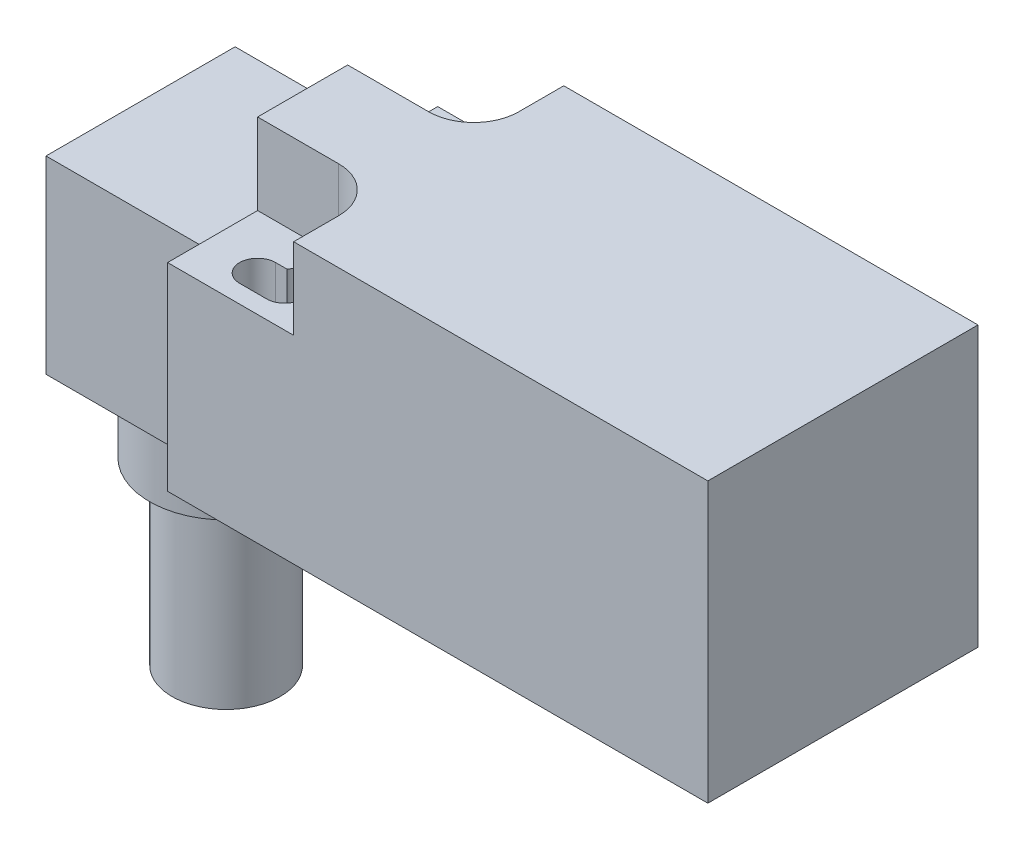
ISO-10303-21;
HEADER;
FILE_DESCRIPTION(('STEP AP214'),'2;1');
FILE_NAME('part.step','',(''),(''),'','','');
FILE_SCHEMA(('AUTOMOTIVE_DESIGN { 1 0 10303 214 1 1 1 1 }'));
ENDSEC;
DATA;
#1=APPLICATION_CONTEXT('core data for automotive mechanical design processes');
#2=APPLICATION_PROTOCOL_DEFINITION('international standard','automotive_design',2000,#1);
#3=PRODUCT_CONTEXT('',#1,'mechanical');
#4=PRODUCT('Part','Part','',(#3));
#5=PRODUCT_RELATED_PRODUCT_CATEGORY('part','',(#4));
#6=PRODUCT_DEFINITION_FORMATION('','',#4);
#7=PRODUCT_DEFINITION_CONTEXT('part definition',#1,'design');
#8=PRODUCT_DEFINITION('design','',#6,#7);
#9=PRODUCT_DEFINITION_SHAPE('','',#8);
#10=(LENGTH_UNIT() NAMED_UNIT(*) SI_UNIT(.MILLI.,.METRE.));
#11=(NAMED_UNIT(*) PLANE_ANGLE_UNIT() SI_UNIT($,.RADIAN.));
#12=(NAMED_UNIT(*) SI_UNIT($,.STERADIAN.) SOLID_ANGLE_UNIT());
#13=UNCERTAINTY_MEASURE_WITH_UNIT(LENGTH_MEASURE(1.E-05),#10,'distance_accuracy_value','');
#14=(GEOMETRIC_REPRESENTATION_CONTEXT(3) GLOBAL_UNCERTAINTY_ASSIGNED_CONTEXT((#13)) GLOBAL_UNIT_ASSIGNED_CONTEXT((#10,
#11,#12)) REPRESENTATION_CONTEXT('',''));
#15=CARTESIAN_POINT('',(0.,0.,0.));
#16=DIRECTION('',(0.,0.,1.));
#17=DIRECTION('',(1.,0.,0.));
#18=AXIS2_PLACEMENT_3D('',#15,#16,#17);
#19=CARTESIAN_POINT('',(-8.5,-24.,0.));
#20=DIRECTION('',(0.,-1.,0.));
#21=DIRECTION('',(0.,0.,-1.));
#22=AXIS2_PLACEMENT_3D('',#19,#20,#21);
#23=PLANE('',#22);
#24=CARTESIAN_POINT('',(-8.5,-24.,0.));
#25=DIRECTION('',(0.,-1.,0.));
#26=DIRECTION('',(0.,0.,-1.));
#27=AXIS2_PLACEMENT_3D('',#24,#25,#26);
#28=CIRCLE('',#27,8.5);
#29=CARTESIAN_POINT('',(-8.5,-24.,-8.5));
#30=VERTEX_POINT('',#29);
#31=EDGE_CURVE('E53',#30,#30,#28,.T.);
#32=ORIENTED_EDGE('',*,*,#31,.T.);
#33=EDGE_LOOP('',(#32));
#34=FACE_BOUND('',#33,.T.);
#35=CARTESIAN_POINT('',(-8.5,-24.,0.));
#36=DIRECTION('',(0.,-1.,0.));
#37=DIRECTION('',(0.,0.,-1.));
#38=AXIS2_PLACEMENT_3D('',#35,#36,#37);
#39=CIRCLE('',#38,6.);
#40=CARTESIAN_POINT('',(-8.5,-24.,-6.));
#41=VERTEX_POINT('',#40);
#42=EDGE_CURVE('E70',#41,#41,#39,.T.);
#43=ORIENTED_EDGE('',*,*,#42,.F.);
#44=EDGE_LOOP('',(#43));
#45=FACE_BOUND('',#44,.T.);
#46=ADVANCED_FACE('F45',(#34,#45),#23,.T.);
#47=CARTESIAN_POINT('',(-8.5,-24.,0.));
#48=DIRECTION('',(0.,1.,0.));
#49=DIRECTION('',(0.,0.,1.));
#50=AXIS2_PLACEMENT_3D('',#47,#48,#49);
#51=CYLINDRICAL_SURFACE('',#50,8.5);
#52=ORIENTED_EDGE('',*,*,#31,.F.);
#53=EDGE_LOOP('',(#52));
#54=FACE_BOUND('',#53,.T.);
#55=CARTESIAN_POINT('',(-8.5,-15.5,0.));
#56=DIRECTION('',(0.,-1.,0.));
#57=DIRECTION('',(0.,0.,-1.));
#58=AXIS2_PLACEMENT_3D('',#55,#56,#57);
#59=CIRCLE('',#58,8.5);
#60=CARTESIAN_POINT('',(-8.5,-15.5,-8.5));
#61=VERTEX_POINT('',#60);
#62=EDGE_CURVE('E59',#61,#61,#59,.T.);
#63=ORIENTED_EDGE('',*,*,#62,.T.);
#64=EDGE_LOOP('',(#63));
#65=FACE_BOUND('',#64,.T.);
#66=ADVANCED_FACE('F47',(#54,#65),#51,.T.);
#67=CARTESIAN_POINT('',(-8.5,-15.5,0.));
#68=DIRECTION('',(0.,-1.,0.));
#69=DIRECTION('',(0.,0.,-1.));
#70=AXIS2_PLACEMENT_3D('',#67,#68,#69);
#71=PLANE('',#70);
#72=ORIENTED_EDGE('',*,*,#62,.F.);
#73=EDGE_LOOP('',(#72));
#74=FACE_BOUND('',#73,.T.);
#75=ADVANCED_FACE('F83',(#74),#71,.F.);
#76=CARTESIAN_POINT('',(-8.5,-44.,0.));
#77=DIRECTION('',(0.,-1.,0.));
#78=DIRECTION('',(0.,0.,-1.));
#79=AXIS2_PLACEMENT_3D('',#76,#77,#78);
#80=PLANE('',#79);
#81=CARTESIAN_POINT('',(-8.5,-44.,0.));
#82=DIRECTION('',(0.,-1.,0.));
#83=DIRECTION('',(0.,0.,-1.));
#84=AXIS2_PLACEMENT_3D('',#81,#82,#83);
#85=CIRCLE('',#84,6.);
#86=CARTESIAN_POINT('',(-8.5,-44.,-6.));
#87=VERTEX_POINT('',#86);
#88=EDGE_CURVE('E65',#87,#87,#85,.T.);
#89=ORIENTED_EDGE('',*,*,#88,.T.);
#90=EDGE_LOOP('',(#89));
#91=FACE_BOUND('',#90,.T.);
#92=CARTESIAN_POINT('',(-8.5,-44.,0.));
#93=DIRECTION('',(0.,-1.,0.));
#94=DIRECTION('',(0.,0.,-1.));
#95=AXIS2_PLACEMENT_3D('',#92,#93,#94);
#96=CIRCLE('',#95,4.25);
#97=CARTESIAN_POINT('',(-8.5,-44.,-4.25));
#98=VERTEX_POINT('',#97);
#99=EDGE_CURVE('E74',#98,#98,#96,.T.);
#100=ORIENTED_EDGE('',*,*,#99,.F.);
#101=EDGE_LOOP('',(#100));
#102=FACE_BOUND('',#101,.T.);
#103=ADVANCED_FACE('F80',(#91,#102),#80,.T.);
#104=CARTESIAN_POINT('',(-8.5,-44.,0.));
#105=DIRECTION('',(0.,1.,0.));
#106=DIRECTION('',(0.,0.,1.));
#107=AXIS2_PLACEMENT_3D('',#104,#105,#106);
#108=CYLINDRICAL_SURFACE('',#107,6.);
#109=ORIENTED_EDGE('',*,*,#88,.F.);
#110=EDGE_LOOP('',(#109));
#111=FACE_BOUND('',#110,.T.);
#112=ORIENTED_EDGE('',*,*,#42,.T.);
#113=EDGE_LOOP('',(#112));
#114=FACE_BOUND('',#113,.T.);
#115=ADVANCED_FACE('F82',(#111,#114),#108,.T.);
#116=CARTESIAN_POINT('',(-8.5,-44.,0.));
#117=DIRECTION('',(0.,1.,0.));
#118=DIRECTION('',(0.,0.,1.));
#119=AXIS2_PLACEMENT_3D('',#116,#117,#118);
#120=CYLINDRICAL_SURFACE('',#119,4.25);
#121=ORIENTED_EDGE('',*,*,#99,.T.);
#122=EDGE_LOOP('',(#121));
#123=FACE_BOUND('',#122,.T.);
#124=CARTESIAN_POINT('',(-8.5,-24.,0.));
#125=DIRECTION('',(0.,-1.,0.));
#126=DIRECTION('',(0.,0.,-1.));
#127=AXIS2_PLACEMENT_3D('',#124,#125,#126);
#128=CIRCLE('',#127,4.25);
#129=CARTESIAN_POINT('',(-8.5,-24.,-4.25));
#130=VERTEX_POINT('',#129);
#131=EDGE_CURVE('E11',#130,#130,#128,.F.);
#132=ORIENTED_EDGE('',*,*,#131,.T.);
#133=EDGE_LOOP('',(#132));
#134=FACE_BOUND('',#133,.T.);
#135=ADVANCED_FACE('F78',(#123,#134),#120,.F.);
#136=ORIENTED_EDGE('',*,*,#131,.F.);
#137=EDGE_LOOP('',(#136));
#138=FACE_BOUND('',#137,.T.);
#139=ADVANCED_FACE('F96',(#138),#23,.T.);
#140=CLOSED_SHELL('',(#46,#66,#75,#103,#115,#135,#139));
#141=MANIFOLD_SOLID_BREP('B2',#140);
#142=CARTESIAN_POINT('',(-18.,-15.5,-10.5));
#143=DIRECTION('',(0.,0.,1.));
#144=DIRECTION('',(0.,-1.,0.));
#145=AXIS2_PLACEMENT_3D('',#142,#143,#144);
#146=PLANE('',#145);
#147=DIRECTION('',(0.,-1.,0.));
#148=VECTOR('',#147,1.);
#149=CARTESIAN_POINT('',(0.,-15.5,-10.5));
#150=LINE('',#149,#148);
#151=CARTESIAN_POINT('',(0.,5.5,-10.5));
#152=VERTEX_POINT('',#151);
#153=CARTESIAN_POINT('',(0.,-15.5,-10.5));
#154=VERTEX_POINT('',#153);
#155=EDGE_CURVE('E211',#152,#154,#150,.T.);
#156=ORIENTED_EDGE('',*,*,#155,.T.);
#157=DIRECTION('',(1.,0.,0.));
#158=VECTOR('',#157,1.);
#159=CARTESIAN_POINT('',(-18.,-15.5,-10.5));
#160=LINE('',#159,#158);
#161=CARTESIAN_POINT('',(-18.,-15.5,-10.5));
#162=VERTEX_POINT('',#161);
#163=EDGE_CURVE('E43',#162,#154,#160,.T.);
#164=ORIENTED_EDGE('',*,*,#163,.F.);
#165=DIRECTION('',(0.,-1.,0.));
#166=VECTOR('',#165,1.);
#167=CARTESIAN_POINT('',(-18.,-15.5,-10.5));
#168=LINE('',#167,#166);
#169=CARTESIAN_POINT('',(-18.,5.5,-10.5));
#170=VERTEX_POINT('',#169);
#171=EDGE_CURVE('E234',#170,#162,#168,.T.);
#172=ORIENTED_EDGE('',*,*,#171,.F.);
#173=DIRECTION('',(1.,0.,0.));
#174=VECTOR('',#173,1.);
#175=CARTESIAN_POINT('',(-18.,5.5,-10.5));
#176=LINE('',#175,#174);
#177=EDGE_CURVE('E224',#170,#152,#176,.T.);
#178=ORIENTED_EDGE('',*,*,#177,.T.);
#179=EDGE_LOOP('',(#156,#164,#172,#178));
#180=FACE_BOUND('',#179,.T.);
#181=ADVANCED_FACE('F166',(#180),#146,.F.);
#182=CARTESIAN_POINT('',(-18.,-15.5,-10.5));
#183=DIRECTION('',(0.,1.,0.));
#184=DIRECTION('',(0.,0.,1.));
#185=AXIS2_PLACEMENT_3D('',#182,#183,#184);
#186=PLANE('',#185);
#187=DIRECTION('',(0.,0.,1.));
#188=VECTOR('',#187,1.);
#189=CARTESIAN_POINT('',(0.,-15.5,-10.5));
#190=LINE('',#189,#188);
#191=CARTESIAN_POINT('',(0.,-15.5,10.5));
#192=VERTEX_POINT('',#191);
#193=EDGE_CURVE('E207',#154,#192,#190,.T.);
#194=ORIENTED_EDGE('',*,*,#193,.T.);
#195=DIRECTION('',(1.,0.,0.));
#196=VECTOR('',#195,1.);
#197=CARTESIAN_POINT('',(-18.,-15.5,10.5));
#198=LINE('',#197,#196);
#199=CARTESIAN_POINT('',(-18.,-15.5,10.5));
#200=VERTEX_POINT('',#199);
#201=EDGE_CURVE('E174',#200,#192,#198,.T.);
#202=ORIENTED_EDGE('',*,*,#201,.F.);
#203=DIRECTION('',(0.,0.,1.));
#204=VECTOR('',#203,1.);
#205=CARTESIAN_POINT('',(-18.,-15.5,-10.5));
#206=LINE('',#205,#204);
#207=EDGE_CURVE('E220',#162,#200,#206,.T.);
#208=ORIENTED_EDGE('',*,*,#207,.F.);
#209=ORIENTED_EDGE('',*,*,#163,.T.);
#210=EDGE_LOOP('',(#194,#202,#208,#209));
#211=FACE_BOUND('',#210,.T.);
#212=ADVANCED_FACE('F219',(#211),#186,.F.);
#213=CARTESIAN_POINT('',(-18.,-15.5,10.5));
#214=DIRECTION('',(0.,0.,-1.));
#215=DIRECTION('',(0.,1.,0.));
#216=AXIS2_PLACEMENT_3D('',#213,#214,#215);
#217=PLANE('',#216);
#218=DIRECTION('',(0.,1.,0.));
#219=VECTOR('',#218,1.);
#220=CARTESIAN_POINT('',(0.,-15.5,10.5));
#221=LINE('',#220,#219);
#222=CARTESIAN_POINT('',(0.,5.5,10.5));
#223=VERTEX_POINT('',#222);
#224=EDGE_CURVE('E212',#192,#223,#221,.T.);
#225=ORIENTED_EDGE('',*,*,#224,.T.);
#226=DIRECTION('',(1.,0.,0.));
#227=VECTOR('',#226,1.);
#228=CARTESIAN_POINT('',(-18.,5.5,10.5));
#229=LINE('',#228,#227);
#230=CARTESIAN_POINT('',(-18.,5.5,10.5));
#231=VERTEX_POINT('',#230);
#232=EDGE_CURVE('E245',#231,#223,#229,.T.);
#233=ORIENTED_EDGE('',*,*,#232,.F.);
#234=DIRECTION('',(0.,1.,0.));
#235=VECTOR('',#234,1.);
#236=CARTESIAN_POINT('',(-18.,-15.5,10.5));
#237=LINE('',#236,#235);
#238=EDGE_CURVE('E186',#200,#231,#237,.T.);
#239=ORIENTED_EDGE('',*,*,#238,.F.);
#240=ORIENTED_EDGE('',*,*,#201,.T.);
#241=EDGE_LOOP('',(#225,#233,#239,#240));
#242=FACE_BOUND('',#241,.T.);
#243=ADVANCED_FACE('F249',(#242),#217,.F.);
#244=CARTESIAN_POINT('',(-18.,5.5,-10.5));
#245=DIRECTION('',(0.,-1.,0.));
#246=DIRECTION('',(0.,0.,-1.));
#247=AXIS2_PLACEMENT_3D('',#244,#245,#246);
#248=PLANE('',#247);
#249=DIRECTION('',(0.,0.,-1.));
#250=VECTOR('',#249,1.);
#251=CARTESIAN_POINT('',(0.,5.5,-10.5));
#252=LINE('',#251,#250);
#253=EDGE_CURVE('E231',#223,#152,#252,.T.);
#254=ORIENTED_EDGE('',*,*,#253,.T.);
#255=ORIENTED_EDGE('',*,*,#177,.F.);
#256=DIRECTION('',(0.,0.,-1.));
#257=VECTOR('',#256,1.);
#258=CARTESIAN_POINT('',(-18.,5.5,-10.5));
#259=LINE('',#258,#257);
#260=EDGE_CURVE('E181',#231,#170,#259,.T.);
#261=ORIENTED_EDGE('',*,*,#260,.F.);
#262=ORIENTED_EDGE('',*,*,#232,.T.);
#263=EDGE_LOOP('',(#254,#255,#261,#262));
#264=FACE_BOUND('',#263,.T.);
#265=ADVANCED_FACE('F251',(#264),#248,.F.);
#266=CARTESIAN_POINT('',(-18.,5.5,-10.5));
#267=DIRECTION('',(1.,0.,0.));
#268=DIRECTION('',(0.,0.,-1.));
#269=AXIS2_PLACEMENT_3D('',#266,#267,#268);
#270=PLANE('',#269);
#271=ORIENTED_EDGE('',*,*,#171,.T.);
#272=ORIENTED_EDGE('',*,*,#207,.T.);
#273=ORIENTED_EDGE('',*,*,#238,.T.);
#274=ORIENTED_EDGE('',*,*,#260,.T.);
#275=EDGE_LOOP('',(#271,#272,#273,#274));
#276=FACE_BOUND('',#275,.T.);
#277=ADVANCED_FACE('F252',(#276),#270,.F.);
#278=CARTESIAN_POINT('',(0.,5.5,-10.5));
#279=DIRECTION('',(1.,0.,0.));
#280=DIRECTION('',(0.,0.,-1.));
#281=AXIS2_PLACEMENT_3D('',#278,#279,#280);
#282=PLANE('',#281);
#283=ORIENTED_EDGE('',*,*,#155,.F.);
#284=ORIENTED_EDGE('',*,*,#253,.F.);
#285=ORIENTED_EDGE('',*,*,#224,.F.);
#286=ORIENTED_EDGE('',*,*,#193,.F.);
#287=EDGE_LOOP('',(#283,#284,#285,#286));
#288=FACE_BOUND('',#287,.T.);
#289=ADVANCED_FACE('F208',(#288),#282,.T.);
#290=CLOSED_SHELL('',(#181,#212,#243,#265,#277,#289));
#291=MANIFOLD_SOLID_BREP('B6',#290);
#292=CARTESIAN_POINT('',(0.,15.5,15.));
#293=DIRECTION('',(1.,0.,0.));
#294=DIRECTION('',(0.,0.,-1.));
#295=AXIS2_PLACEMENT_3D('',#292,#293,#294);
#296=PLANE('',#295);
#297=DIRECTION('',(0.,0.,1.));
#298=VECTOR('',#297,1.);
#299=CARTESIAN_POINT('',(0.,6.5,15.));
#300=LINE('',#299,#298);
#301=CARTESIAN_POINT('',(0.,6.5,5.));
#302=VERTEX_POINT('',#301);
#303=CARTESIAN_POINT('',(0.,6.5,15.));
#304=VERTEX_POINT('',#303);
#305=EDGE_CURVE('E571',#302,#304,#300,.T.);
#306=ORIENTED_EDGE('',*,*,#305,.F.);
#307=DIRECTION('',(0.,1.,0.));
#308=VECTOR('',#307,1.);
#309=CARTESIAN_POINT('',(0.,6.5,5.));
#310=LINE('',#309,#308);
#311=CARTESIAN_POINT('',(0.,15.5,5.));
#312=VERTEX_POINT('',#311);
#313=EDGE_CURVE('E591',#302,#312,#310,.T.);
#314=ORIENTED_EDGE('',*,*,#313,.T.);
#315=DIRECTION('',(0.,0.,-1.));
#316=VECTOR('',#315,1.);
#317=CARTESIAN_POINT('',(0.,15.5,15.));
#318=LINE('',#317,#316);
#319=CARTESIAN_POINT('',(0.,15.5,-5.));
#320=VERTEX_POINT('',#319);
#321=EDGE_CURVE('E672',#312,#320,#318,.T.);
#322=ORIENTED_EDGE('',*,*,#321,.T.);
#323=DIRECTION('',(0.,1.,0.));
#324=VECTOR('',#323,1.);
#325=CARTESIAN_POINT('',(0.,6.5,-5.));
#326=LINE('',#325,#324);
#327=CARTESIAN_POINT('',(0.,6.5,-5.));
#328=VERTEX_POINT('',#327);
#329=EDGE_CURVE('E632',#328,#320,#326,.T.);
#330=ORIENTED_EDGE('',*,*,#329,.F.);
#331=DIRECTION('',(0.,0.,1.));
#332=VECTOR('',#331,1.);
#333=CARTESIAN_POINT('',(0.,6.5,-15.));
#334=LINE('',#333,#332);
#335=CARTESIAN_POINT('',(0.,6.5,-15.));
#336=VERTEX_POINT('',#335);
#337=EDGE_CURVE('E614',#336,#328,#334,.T.);
#338=ORIENTED_EDGE('',*,*,#337,.F.);
#339=DIRECTION('',(0.,-1.,0.));
#340=VECTOR('',#339,1.);
#341=CARTESIAN_POINT('',(0.,15.5,-15.));
#342=LINE('',#341,#340);
#343=CARTESIAN_POINT('',(0.,-15.5,-15.));
#344=VERTEX_POINT('',#343);
#345=EDGE_CURVE('E637',#336,#344,#342,.T.);
#346=ORIENTED_EDGE('',*,*,#345,.T.);
#347=DIRECTION('',(0.,0.,-1.));
#348=VECTOR('',#347,1.);
#349=CARTESIAN_POINT('',(0.,-15.5,15.));
#350=LINE('',#349,#348);
#351=CARTESIAN_POINT('',(0.,-15.5,15.));
#352=VERTEX_POINT('',#351);
#353=EDGE_CURVE('E683',#352,#344,#350,.T.);
#354=ORIENTED_EDGE('',*,*,#353,.F.);
#355=DIRECTION('',(0.,-1.,0.));
#356=VECTOR('',#355,1.);
#357=CARTESIAN_POINT('',(0.,15.5,15.));
#358=LINE('',#357,#356);
#359=EDGE_CURVE('E659',#304,#352,#358,.T.);
#360=ORIENTED_EDGE('',*,*,#359,.F.);
#361=EDGE_LOOP('',(#306,#314,#322,#330,#338,#346,#354,#360));
#362=FACE_BOUND('',#361,.T.);
#363=ADVANCED_FACE('F307',(#362),#296,.F.);
#364=CARTESIAN_POINT('',(0.,-15.5,15.));
#365=DIRECTION('',(0.,1.,0.));
#366=DIRECTION('',(0.,0.,1.));
#367=AXIS2_PLACEMENT_3D('',#364,#365,#366);
#368=PLANE('',#367);
#369=DIRECTION('',(0.,0.,1.));
#370=VECTOR('',#369,1.);
#371=CARTESIAN_POINT('',(11.,-15.5,-10.));
#372=LINE('',#371,#370);
#373=CARTESIAN_POINT('',(11.,-15.5,-11.));
#374=VERTEX_POINT('',#373);
#375=CARTESIAN_POINT('',(11.,-15.5,-10.));
#376=VERTEX_POINT('',#375);
#377=EDGE_CURVE('E480',#374,#376,#372,.T.);
#378=ORIENTED_EDGE('',*,*,#377,.F.);
#379=CARTESIAN_POINT('',(8.99999999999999,-15.5,-11.));
#380=DIRECTION('',(0.,-1.,0.));
#381=DIRECTION('',(0.,0.,1.));
#382=AXIS2_PLACEMENT_3D('',#379,#380,#381);
#383=CIRCLE('',#382,2.);
#384=CARTESIAN_POINT('',(8.99999999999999,-15.5,-13.));
#385=VERTEX_POINT('',#384);
#386=EDGE_CURVE('E322',#385,#374,#383,.T.);
#387=ORIENTED_EDGE('',*,*,#386,.F.);
#388=DIRECTION('',(1.,0.,0.));
#389=VECTOR('',#388,1.);
#390=CARTESIAN_POINT('',(6.00000000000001,-15.5,-13.));
#391=LINE('',#390,#389);
#392=CARTESIAN_POINT('',(6.00000000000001,-15.5,-13.));
#393=VERTEX_POINT('',#392);
#394=EDGE_CURVE('E502',#393,#385,#391,.T.);
#395=ORIENTED_EDGE('',*,*,#394,.F.);
#396=CARTESIAN_POINT('',(6.,-15.5,-11.));
#397=DIRECTION('',(0.,-1.,0.));
#398=DIRECTION('',(0.,0.,1.));
#399=AXIS2_PLACEMENT_3D('',#396,#397,#398);
#400=CIRCLE('',#399,2.);
#401=CARTESIAN_POINT('',(6.00000000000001,-15.5,-9.));
#402=VERTEX_POINT('',#401);
#403=EDGE_CURVE('E495',#402,#393,#400,.T.);
#404=ORIENTED_EDGE('',*,*,#403,.F.);
#405=DIRECTION('',(-1.,0.,0.));
#406=VECTOR('',#405,1.);
#407=CARTESIAN_POINT('',(6.00000000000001,-15.5,-9.));
#408=LINE('',#407,#406);
#409=CARTESIAN_POINT('',(7.26794919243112,-15.5,-9.));
#410=VERTEX_POINT('',#409);
#411=EDGE_CURVE('E489',#410,#402,#408,.T.);
#412=ORIENTED_EDGE('',*,*,#411,.F.);
#413=CARTESIAN_POINT('',(8.99999999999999,-15.5,-10.));
#414=DIRECTION('',(0.,-1.,0.));
#415=DIRECTION('',(0.,0.,1.));
#416=AXIS2_PLACEMENT_3D('',#413,#414,#415);
#417=CIRCLE('',#416,2.);
#418=EDGE_CURVE('E470',#376,#410,#417,.T.);
#419=ORIENTED_EDGE('',*,*,#418,.F.);
#420=EDGE_LOOP('',(#378,#387,#395,#404,#412,#419));
#421=FACE_BOUND('',#420,.T.);
#422=DIRECTION('',(0.,0.,1.));
#423=VECTOR('',#422,1.);
#424=CARTESIAN_POINT('',(11.,-15.5,10.));
#425=LINE('',#424,#423);
#426=CARTESIAN_POINT('',(11.,-15.5,10.));
#427=VERTEX_POINT('',#426);
#428=CARTESIAN_POINT('',(11.,-15.5,11.));
#429=VERTEX_POINT('',#428);
#430=EDGE_CURVE('E522',#427,#429,#425,.T.);
#431=ORIENTED_EDGE('',*,*,#430,.F.);
#432=CARTESIAN_POINT('',(8.99999999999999,-15.5,10.));
#433=DIRECTION('',(0.,-1.,0.));
#434=DIRECTION('',(0.,0.,-1.));
#435=AXIS2_PLACEMENT_3D('',#432,#433,#434);
#436=CIRCLE('',#435,2.);
#437=CARTESIAN_POINT('',(7.26794919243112,-15.5,9.));
#438=VERTEX_POINT('',#437);
#439=EDGE_CURVE('E509',#438,#427,#436,.T.);
#440=ORIENTED_EDGE('',*,*,#439,.F.);
#441=DIRECTION('',(1.,0.,0.));
#442=VECTOR('',#441,1.);
#443=CARTESIAN_POINT('',(6.00000000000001,-15.5,9.));
#444=LINE('',#443,#442);
#445=CARTESIAN_POINT('',(6.00000000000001,-15.5,9.));
#446=VERTEX_POINT('',#445);
#447=EDGE_CURVE('E538',#446,#438,#444,.T.);
#448=ORIENTED_EDGE('',*,*,#447,.F.);
#449=CARTESIAN_POINT('',(6.,-15.5,11.));
#450=DIRECTION('',(0.,-1.,0.));
#451=DIRECTION('',(0.,0.,-1.));
#452=AXIS2_PLACEMENT_3D('',#449,#450,#451);
#453=CIRCLE('',#452,2.);
#454=CARTESIAN_POINT('',(6.00000000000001,-15.5,13.));
#455=VERTEX_POINT('',#454);
#456=EDGE_CURVE('E534',#455,#446,#453,.T.);
#457=ORIENTED_EDGE('',*,*,#456,.F.);
#458=DIRECTION('',(-1.,0.,0.));
#459=VECTOR('',#458,1.);
#460=CARTESIAN_POINT('',(6.00000000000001,-15.5,13.));
#461=LINE('',#460,#459);
#462=CARTESIAN_POINT('',(8.99999999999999,-15.5,13.));
#463=VERTEX_POINT('',#462);
#464=EDGE_CURVE('E530',#463,#455,#461,.T.);
#465=ORIENTED_EDGE('',*,*,#464,.F.);
#466=CARTESIAN_POINT('',(8.99999999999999,-15.5,11.));
#467=DIRECTION('',(0.,-1.,0.));
#468=DIRECTION('',(0.,0.,-1.));
#469=AXIS2_PLACEMENT_3D('',#466,#467,#468);
#470=CIRCLE('',#469,2.);
#471=EDGE_CURVE('E526',#429,#463,#470,.T.);
#472=ORIENTED_EDGE('',*,*,#471,.F.);
#473=EDGE_LOOP('',(#431,#440,#448,#457,#465,#472));
#474=FACE_BOUND('',#473,.T.);
#475=DIRECTION('',(1.,0.,0.));
#476=VECTOR('',#475,1.);
#477=CARTESIAN_POINT('',(0.,-15.5,-15.));
#478=LINE('',#477,#476);
#479=CARTESIAN_POINT('',(60.,-15.5,-15.));
#480=VERTEX_POINT('',#479);
#481=EDGE_CURVE('E649',#344,#480,#478,.T.);
#482=ORIENTED_EDGE('',*,*,#481,.T.);
#483=DIRECTION('',(0.,0.,-1.));
#484=VECTOR('',#483,1.);
#485=CARTESIAN_POINT('',(60.,-15.5,15.));
#486=LINE('',#485,#484);
#487=CARTESIAN_POINT('',(60.,-15.5,15.));
#488=VERTEX_POINT('',#487);
#489=EDGE_CURVE('E679',#488,#480,#486,.T.);
#490=ORIENTED_EDGE('',*,*,#489,.F.);
#491=DIRECTION('',(1.,0.,0.));
#492=VECTOR('',#491,1.);
#493=CARTESIAN_POINT('',(0.,-15.5,15.));
#494=LINE('',#493,#492);
#495=EDGE_CURVE('E662',#352,#488,#494,.T.);
#496=ORIENTED_EDGE('',*,*,#495,.F.);
#497=ORIENTED_EDGE('',*,*,#353,.T.);
#498=EDGE_LOOP('',(#482,#490,#496,#497));
#499=FACE_BOUND('',#498,.T.);
#500=ADVANCED_FACE('F485',(#421,#474,#499),#368,.F.);
#501=CARTESIAN_POINT('',(60.,15.5,15.));
#502=DIRECTION('',(-1.,0.,0.));
#503=DIRECTION('',(0.,0.,1.));
#504=AXIS2_PLACEMENT_3D('',#501,#502,#503);
#505=PLANE('',#504);
#506=DIRECTION('',(0.,1.,0.));
#507=VECTOR('',#506,1.);
#508=CARTESIAN_POINT('',(60.,15.5,-15.));
#509=LINE('',#508,#507);
#510=CARTESIAN_POINT('',(60.,15.5,-15.));
#511=VERTEX_POINT('',#510);
#512=EDGE_CURVE('E652',#480,#511,#509,.T.);
#513=ORIENTED_EDGE('',*,*,#512,.T.);
#514=DIRECTION('',(0.,0.,-1.));
#515=VECTOR('',#514,1.);
#516=CARTESIAN_POINT('',(60.,15.5,15.));
#517=LINE('',#516,#515);
#518=CARTESIAN_POINT('',(60.,15.5,15.));
#519=VERTEX_POINT('',#518);
#520=EDGE_CURVE('E675',#519,#511,#517,.T.);
#521=ORIENTED_EDGE('',*,*,#520,.F.);
#522=DIRECTION('',(0.,1.,0.));
#523=VECTOR('',#522,1.);
#524=CARTESIAN_POINT('',(60.,15.5,15.));
#525=LINE('',#524,#523);
#526=EDGE_CURVE('E665',#488,#519,#525,.T.);
#527=ORIENTED_EDGE('',*,*,#526,.F.);
#528=ORIENTED_EDGE('',*,*,#489,.T.);
#529=EDGE_LOOP('',(#513,#521,#527,#528));
#530=FACE_BOUND('',#529,.T.);
#531=ADVANCED_FACE('F752',(#530),#505,.F.);
#532=CARTESIAN_POINT('',(0.,15.5,15.));
#533=DIRECTION('',(0.,-1.,0.));
#534=DIRECTION('',(0.,0.,-1.));
#535=AXIS2_PLACEMENT_3D('',#532,#533,#534);
#536=PLANE('',#535);
#537=ORIENTED_EDGE('',*,*,#321,.F.);
#538=DIRECTION('',(-1.,0.,0.));
#539=VECTOR('',#538,1.);
#540=CARTESIAN_POINT('',(0.,15.5,5.));
#541=LINE('',#540,#539);
#542=CARTESIAN_POINT('',(8.99999999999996,15.5,5.));
#543=VERTEX_POINT('',#542);
#544=EDGE_CURVE('E569',#543,#312,#541,.T.);
#545=ORIENTED_EDGE('',*,*,#544,.F.);
#546=CARTESIAN_POINT('',(9.,15.5,10.));
#547=DIRECTION('',(0.,1.,0.));
#548=DIRECTION('',(0.,0.,-1.));
#549=AXIS2_PLACEMENT_3D('',#546,#547,#548);
#550=CIRCLE('',#549,5.);
#551=CARTESIAN_POINT('',(14.,15.5,10.));
#552=VERTEX_POINT('',#551);
#553=EDGE_CURVE('E565',#552,#543,#550,.T.);
#554=ORIENTED_EDGE('',*,*,#553,.F.);
#555=DIRECTION('',(0.,0.,-1.));
#556=VECTOR('',#555,1.);
#557=CARTESIAN_POINT('',(14.,15.5,15.));
#558=LINE('',#557,#556);
#559=CARTESIAN_POINT('',(14.,15.5,15.));
#560=VERTEX_POINT('',#559);
#561=EDGE_CURVE('E546',#560,#552,#558,.T.);
#562=ORIENTED_EDGE('',*,*,#561,.F.);
#563=DIRECTION('',(-1.,0.,0.));
#564=VECTOR('',#563,1.);
#565=CARTESIAN_POINT('',(0.,15.5,15.));
#566=LINE('',#565,#564);
#567=EDGE_CURVE('E668',#519,#560,#566,.T.);
#568=ORIENTED_EDGE('',*,*,#567,.F.);
#569=ORIENTED_EDGE('',*,*,#520,.T.);
#570=DIRECTION('',(-1.,0.,0.));
#571=VECTOR('',#570,1.);
#572=CARTESIAN_POINT('',(0.,15.5,-15.));
#573=LINE('',#572,#571);
#574=CARTESIAN_POINT('',(14.,15.5,-15.));
#575=VERTEX_POINT('',#574);
#576=EDGE_CURVE('E655',#511,#575,#573,.T.);
#577=ORIENTED_EDGE('',*,*,#576,.T.);
#578=DIRECTION('',(0.,0.,-1.));
#579=VECTOR('',#578,1.);
#580=CARTESIAN_POINT('',(14.,15.5,-15.));
#581=LINE('',#580,#579);
#582=CARTESIAN_POINT('',(14.,15.5,-10.));
#583=VERTEX_POINT('',#582);
#584=EDGE_CURVE('E611',#583,#575,#581,.T.);
#585=ORIENTED_EDGE('',*,*,#584,.F.);
#586=CARTESIAN_POINT('',(9.,15.5,-10.));
#587=DIRECTION('',(0.,1.,0.));
#588=DIRECTION('',(0.,0.,1.));
#589=AXIS2_PLACEMENT_3D('',#586,#587,#588);
#590=CIRCLE('',#589,5.);
#591=CARTESIAN_POINT('',(8.99999999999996,15.5,-5.));
#592=VERTEX_POINT('',#591);
#593=EDGE_CURVE('E607',#592,#583,#590,.T.);
#594=ORIENTED_EDGE('',*,*,#593,.F.);
#595=DIRECTION('',(1.,0.,0.));
#596=VECTOR('',#595,1.);
#597=CARTESIAN_POINT('',(0.,15.5,-5.));
#598=LINE('',#597,#596);
#599=EDGE_CURVE('E595',#320,#592,#598,.T.);
#600=ORIENTED_EDGE('',*,*,#599,.F.);
#601=EDGE_LOOP('',(#537,#545,#554,#562,#568,#569,#577,#585,#594,#600));
#602=FACE_BOUND('',#601,.T.);
#603=ADVANCED_FACE('F771',(#602),#536,.F.);
#604=CARTESIAN_POINT('',(0.,-15.5,15.));
#605=DIRECTION('',(0.,0.,1.));
#606=DIRECTION('',(1.,0.,0.));
#607=AXIS2_PLACEMENT_3D('',#604,#605,#606);
#608=PLANE('',#607);
#609=DIRECTION('',(0.,1.,0.));
#610=VECTOR('',#609,1.);
#611=CARTESIAN_POINT('',(14.,6.5,15.));
#612=LINE('',#611,#610);
#613=CARTESIAN_POINT('',(14.,6.5,15.));
#614=VERTEX_POINT('',#613);
#615=EDGE_CURVE('E590',#614,#560,#612,.T.);
#616=ORIENTED_EDGE('',*,*,#615,.F.);
#617=DIRECTION('',(1.,0.,0.));
#618=VECTOR('',#617,1.);
#619=CARTESIAN_POINT('',(0.,6.5,15.));
#620=LINE('',#619,#618);
#621=EDGE_CURVE('E574',#304,#614,#620,.T.);
#622=ORIENTED_EDGE('',*,*,#621,.F.);
#623=ORIENTED_EDGE('',*,*,#359,.T.);
#624=ORIENTED_EDGE('',*,*,#495,.T.);
#625=ORIENTED_EDGE('',*,*,#526,.T.);
#626=ORIENTED_EDGE('',*,*,#567,.T.);
#627=EDGE_LOOP('',(#616,#622,#623,#624,#625,#626));
#628=FACE_BOUND('',#627,.T.);
#629=ADVANCED_FACE('F763',(#628),#608,.T.);
#630=CARTESIAN_POINT('',(0.,-15.5,-15.));
#631=DIRECTION('',(0.,0.,1.));
#632=DIRECTION('',(1.,0.,0.));
#633=AXIS2_PLACEMENT_3D('',#630,#631,#632);
#634=PLANE('',#633);
#635=DIRECTION('',(-1.,0.,0.));
#636=VECTOR('',#635,1.);
#637=CARTESIAN_POINT('',(0.,6.5,-15.));
#638=LINE('',#637,#636);
#639=CARTESIAN_POINT('',(14.,6.5,-15.));
#640=VERTEX_POINT('',#639);
#641=EDGE_CURVE('E629',#640,#336,#638,.T.);
#642=ORIENTED_EDGE('',*,*,#641,.F.);
#643=DIRECTION('',(0.,1.,0.));
#644=VECTOR('',#643,1.);
#645=CARTESIAN_POINT('',(14.,6.5,-15.));
#646=LINE('',#645,#644);
#647=EDGE_CURVE('E633',#640,#575,#646,.T.);
#648=ORIENTED_EDGE('',*,*,#647,.T.);
#649=ORIENTED_EDGE('',*,*,#576,.F.);
#650=ORIENTED_EDGE('',*,*,#512,.F.);
#651=ORIENTED_EDGE('',*,*,#481,.F.);
#652=ORIENTED_EDGE('',*,*,#345,.F.);
#653=EDGE_LOOP('',(#642,#648,#649,#650,#651,#652));
#654=FACE_BOUND('',#653,.T.);
#655=ADVANCED_FACE('F796',(#654),#634,.F.);
#656=CARTESIAN_POINT('',(14.,6.5,-15.));
#657=DIRECTION('',(1.,0.,0.));
#658=DIRECTION('',(0.,0.,-1.));
#659=AXIS2_PLACEMENT_3D('',#656,#657,#658);
#660=PLANE('',#659);
#661=ORIENTED_EDGE('',*,*,#584,.T.);
#662=ORIENTED_EDGE('',*,*,#647,.F.);
#663=DIRECTION('',(0.,0.,-1.));
#664=VECTOR('',#663,1.);
#665=CARTESIAN_POINT('',(14.,6.5,-15.));
#666=LINE('',#665,#664);
#667=CARTESIAN_POINT('',(14.,6.5,-10.));
#668=VERTEX_POINT('',#667);
#669=EDGE_CURVE('E626',#668,#640,#666,.T.);
#670=ORIENTED_EDGE('',*,*,#669,.F.);
#671=DIRECTION('',(0.,1.,0.));
#672=VECTOR('',#671,1.);
#673=CARTESIAN_POINT('',(14.,6.5,-10.));
#674=LINE('',#673,#672);
#675=EDGE_CURVE('E638',#668,#583,#674,.T.);
#676=ORIENTED_EDGE('',*,*,#675,.T.);
#677=EDGE_LOOP('',(#661,#662,#670,#676));
#678=FACE_BOUND('',#677,.T.);
#679=ADVANCED_FACE('F792',(#678),#660,.F.);
#680=CARTESIAN_POINT('',(9.,6.5,-10.));
#681=DIRECTION('',(0.,1.,0.));
#682=DIRECTION('',(0.,0.,1.));
#683=AXIS2_PLACEMENT_3D('',#680,#681,#682);
#684=CYLINDRICAL_SURFACE('',#683,5.);
#685=ORIENTED_EDGE('',*,*,#593,.T.);
#686=ORIENTED_EDGE('',*,*,#675,.F.);
#687=CARTESIAN_POINT('',(9.,6.5,-10.));
#688=DIRECTION('',(0.,1.,0.));
#689=DIRECTION('',(0.,0.,1.));
#690=AXIS2_PLACEMENT_3D('',#687,#688,#689);
#691=CIRCLE('',#690,5.);
#692=CARTESIAN_POINT('',(8.99999999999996,6.5,-5.));
#693=VERTEX_POINT('',#692);
#694=EDGE_CURVE('E622',#693,#668,#691,.T.);
#695=ORIENTED_EDGE('',*,*,#694,.F.);
#696=DIRECTION('',(0.,1.,0.));
#697=VECTOR('',#696,1.);
#698=CARTESIAN_POINT('',(8.99999999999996,6.5,-5.));
#699=LINE('',#698,#697);
#700=EDGE_CURVE('E641',#693,#592,#699,.T.);
#701=ORIENTED_EDGE('',*,*,#700,.T.);
#702=EDGE_LOOP('',(#685,#686,#695,#701));
#703=FACE_BOUND('',#702,.T.);
#704=ADVANCED_FACE('F795',(#703),#684,.F.);
#705=CARTESIAN_POINT('',(0.,6.5,-5.));
#706=DIRECTION('',(0.,0.,1.));
#707=DIRECTION('',(1.,0.,0.));
#708=AXIS2_PLACEMENT_3D('',#705,#706,#707);
#709=PLANE('',#708);
#710=ORIENTED_EDGE('',*,*,#599,.T.);
#711=ORIENTED_EDGE('',*,*,#700,.F.);
#712=DIRECTION('',(1.,0.,0.));
#713=VECTOR('',#712,1.);
#714=CARTESIAN_POINT('',(0.,6.5,-5.));
#715=LINE('',#714,#713);
#716=EDGE_CURVE('E618',#328,#693,#715,.T.);
#717=ORIENTED_EDGE('',*,*,#716,.F.);
#718=ORIENTED_EDGE('',*,*,#329,.T.);
#719=EDGE_LOOP('',(#710,#711,#717,#718));
#720=FACE_BOUND('',#719,.T.);
#721=ADVANCED_FACE('F785',(#720),#709,.F.);
#722=CARTESIAN_POINT('',(9.,6.5,-10.));
#723=DIRECTION('',(0.,1.,0.));
#724=DIRECTION('',(0.,0.,1.));
#725=AXIS2_PLACEMENT_3D('',#722,#723,#724);
#726=PLANE('',#725);
#727=CARTESIAN_POINT('',(8.99999999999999,6.5,-11.));
#728=DIRECTION('',(0.,1.,0.));
#729=DIRECTION('',(0.,0.,1.));
#730=AXIS2_PLACEMENT_3D('',#727,#728,#729);
#731=CIRCLE('',#730,2.);
#732=CARTESIAN_POINT('',(11.,6.5,-11.));
#733=VERTEX_POINT('',#732);
#734=CARTESIAN_POINT('',(8.99999999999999,6.5,-13.));
#735=VERTEX_POINT('',#734);
#736=EDGE_CURVE('E164',#733,#735,#731,.T.);
#737=ORIENTED_EDGE('',*,*,#736,.F.);
#738=DIRECTION('',(0.,0.,-1.));
#739=VECTOR('',#738,1.);
#740=CARTESIAN_POINT('',(11.,6.5,-10.));
#741=LINE('',#740,#739);
#742=CARTESIAN_POINT('',(11.,6.5,-10.));
#743=VERTEX_POINT('',#742);
#744=EDGE_CURVE('E710',#743,#733,#741,.T.);
#745=ORIENTED_EDGE('',*,*,#744,.F.);
#746=CARTESIAN_POINT('',(8.99999999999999,6.5,-10.));
#747=DIRECTION('',(0.,1.,0.));
#748=DIRECTION('',(0.,0.,1.));
#749=AXIS2_PLACEMENT_3D('',#746,#747,#748);
#750=CIRCLE('',#749,2.);
#751=CARTESIAN_POINT('',(7.26794919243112,6.5,-9.));
#752=VERTEX_POINT('',#751);
#753=EDGE_CURVE('E473',#752,#743,#750,.T.);
#754=ORIENTED_EDGE('',*,*,#753,.F.);
#755=DIRECTION('',(1.,0.,0.));
#756=VECTOR('',#755,1.);
#757=CARTESIAN_POINT('',(9.,6.5,-9.));
#758=LINE('',#757,#756);
#759=CARTESIAN_POINT('',(6.00000000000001,6.5,-9.));
#760=VERTEX_POINT('',#759);
#761=EDGE_CURVE('E715',#760,#752,#758,.T.);
#762=ORIENTED_EDGE('',*,*,#761,.F.);
#763=CARTESIAN_POINT('',(6.,6.5,-11.));
#764=DIRECTION('',(0.,1.,0.));
#765=DIRECTION('',(0.,0.,1.));
#766=AXIS2_PLACEMENT_3D('',#763,#764,#765);
#767=CIRCLE('',#766,2.);
#768=CARTESIAN_POINT('',(6.00000000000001,6.5,-13.));
#769=VERTEX_POINT('',#768);
#770=EDGE_CURVE('E718',#769,#760,#767,.T.);
#771=ORIENTED_EDGE('',*,*,#770,.F.);
#772=DIRECTION('',(-1.,0.,0.));
#773=VECTOR('',#772,1.);
#774=CARTESIAN_POINT('',(9.,6.5,-13.));
#775=LINE('',#774,#773);
#776=EDGE_CURVE('E315',#735,#769,#775,.T.);
#777=ORIENTED_EDGE('',*,*,#776,.F.);
#778=EDGE_LOOP('',(#737,#745,#754,#762,#771,#777));
#779=FACE_BOUND('',#778,.T.);
#780=ORIENTED_EDGE('',*,*,#337,.T.);
#781=ORIENTED_EDGE('',*,*,#716,.T.);
#782=ORIENTED_EDGE('',*,*,#694,.T.);
#783=ORIENTED_EDGE('',*,*,#669,.T.);
#784=ORIENTED_EDGE('',*,*,#641,.T.);
#785=EDGE_LOOP('',(#780,#781,#782,#783,#784));
#786=FACE_BOUND('',#785,.T.);
#787=ADVANCED_FACE('F734',(#779,#786),#726,.T.);
#788=CARTESIAN_POINT('',(0.,6.5,5.));
#789=DIRECTION('',(0.,0.,-1.));
#790=DIRECTION('',(-1.,0.,0.));
#791=AXIS2_PLACEMENT_3D('',#788,#789,#790);
#792=PLANE('',#791);
#793=ORIENTED_EDGE('',*,*,#544,.T.);
#794=ORIENTED_EDGE('',*,*,#313,.F.);
#795=DIRECTION('',(-1.,0.,0.));
#796=VECTOR('',#795,1.);
#797=CARTESIAN_POINT('',(0.,6.5,5.));
#798=LINE('',#797,#796);
#799=CARTESIAN_POINT('',(8.99999999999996,6.5,5.));
#800=VERTEX_POINT('',#799);
#801=EDGE_CURVE('E586',#800,#302,#798,.T.);
#802=ORIENTED_EDGE('',*,*,#801,.F.);
#803=DIRECTION('',(0.,1.,0.));
#804=VECTOR('',#803,1.);
#805=CARTESIAN_POINT('',(8.99999999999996,6.5,5.));
#806=LINE('',#805,#804);
#807=EDGE_CURVE('E596',#800,#543,#806,.T.);
#808=ORIENTED_EDGE('',*,*,#807,.T.);
#809=EDGE_LOOP('',(#793,#794,#802,#808));
#810=FACE_BOUND('',#809,.T.);
#811=ADVANCED_FACE('F777',(#810),#792,.F.);
#812=CARTESIAN_POINT('',(9.,6.5,10.));
#813=DIRECTION('',(0.,1.,0.));
#814=DIRECTION('',(0.,0.,1.));
#815=AXIS2_PLACEMENT_3D('',#812,#813,#814);
#816=CYLINDRICAL_SURFACE('',#815,5.);
#817=ORIENTED_EDGE('',*,*,#553,.T.);
#818=ORIENTED_EDGE('',*,*,#807,.F.);
#819=CARTESIAN_POINT('',(9.,6.5,10.));
#820=DIRECTION('',(0.,1.,0.));
#821=DIRECTION('',(0.,0.,-1.));
#822=AXIS2_PLACEMENT_3D('',#819,#820,#821);
#823=CIRCLE('',#822,5.);
#824=CARTESIAN_POINT('',(14.,6.5,10.));
#825=VERTEX_POINT('',#824);
#826=EDGE_CURVE('E582',#825,#800,#823,.T.);
#827=ORIENTED_EDGE('',*,*,#826,.F.);
#828=DIRECTION('',(0.,1.,0.));
#829=VECTOR('',#828,1.);
#830=CARTESIAN_POINT('',(14.,6.5,10.));
#831=LINE('',#830,#829);
#832=EDGE_CURVE('E599',#825,#552,#831,.T.);
#833=ORIENTED_EDGE('',*,*,#832,.T.);
#834=EDGE_LOOP('',(#817,#818,#827,#833));
#835=FACE_BOUND('',#834,.T.);
#836=ADVANCED_FACE('F774',(#835),#816,.F.);
#837=CARTESIAN_POINT('',(14.,6.5,15.));
#838=DIRECTION('',(1.,0.,0.));
#839=DIRECTION('',(0.,0.,-1.));
#840=AXIS2_PLACEMENT_3D('',#837,#838,#839);
#841=PLANE('',#840);
#842=ORIENTED_EDGE('',*,*,#561,.T.);
#843=ORIENTED_EDGE('',*,*,#832,.F.);
#844=DIRECTION('',(0.,0.,-1.));
#845=VECTOR('',#844,1.);
#846=CARTESIAN_POINT('',(14.,6.5,15.));
#847=LINE('',#846,#845);
#848=EDGE_CURVE('E578',#614,#825,#847,.T.);
#849=ORIENTED_EDGE('',*,*,#848,.F.);
#850=ORIENTED_EDGE('',*,*,#615,.T.);
#851=EDGE_LOOP('',(#842,#843,#849,#850));
#852=FACE_BOUND('',#851,.T.);
#853=ADVANCED_FACE('F768',(#852),#841,.F.);
#854=CARTESIAN_POINT('',(9.,6.5,10.));
#855=DIRECTION('',(0.,-1.,0.));
#856=DIRECTION('',(0.,0.,-1.));
#857=AXIS2_PLACEMENT_3D('',#854,#855,#856);
#858=PLANE('',#857);
#859=DIRECTION('',(1.,0.,0.));
#860=VECTOR('',#859,1.);
#861=CARTESIAN_POINT('',(9.,6.5,9.));
#862=LINE('',#861,#860);
#863=CARTESIAN_POINT('',(6.00000000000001,6.5,9.));
#864=VERTEX_POINT('',#863);
#865=CARTESIAN_POINT('',(7.26794919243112,6.5,9.));
#866=VERTEX_POINT('',#865);
#867=EDGE_CURVE('E702',#864,#866,#862,.T.);
#868=ORIENTED_EDGE('',*,*,#867,.T.);
#869=CARTESIAN_POINT('',(8.99999999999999,6.5,10.));
#870=DIRECTION('',(0.,-1.,0.));
#871=DIRECTION('',(0.,0.,-1.));
#872=AXIS2_PLACEMENT_3D('',#869,#870,#871);
#873=CIRCLE('',#872,2.);
#874=CARTESIAN_POINT('',(11.,6.5,10.));
#875=VERTEX_POINT('',#874);
#876=EDGE_CURVE('E706',#866,#875,#873,.T.);
#877=ORIENTED_EDGE('',*,*,#876,.T.);
#878=DIRECTION('',(0.,0.,1.));
#879=VECTOR('',#878,1.);
#880=CARTESIAN_POINT('',(11.,6.5,10.));
#881=LINE('',#880,#879);
#882=CARTESIAN_POINT('',(11.,6.5,11.));
#883=VERTEX_POINT('',#882);
#884=EDGE_CURVE('E687',#875,#883,#881,.T.);
#885=ORIENTED_EDGE('',*,*,#884,.T.);
#886=CARTESIAN_POINT('',(8.99999999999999,6.5,11.));
#887=DIRECTION('',(0.,-1.,0.));
#888=DIRECTION('',(0.,0.,-1.));
#889=AXIS2_PLACEMENT_3D('',#886,#887,#888);
#890=CIRCLE('',#889,2.);
#891=CARTESIAN_POINT('',(8.99999999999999,6.5,13.));
#892=VERTEX_POINT('',#891);
#893=EDGE_CURVE('E691',#883,#892,#890,.T.);
#894=ORIENTED_EDGE('',*,*,#893,.T.);
#895=DIRECTION('',(-1.,0.,0.));
#896=VECTOR('',#895,1.);
#897=CARTESIAN_POINT('',(9.,6.5,13.));
#898=LINE('',#897,#896);
#899=CARTESIAN_POINT('',(6.00000000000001,6.5,13.));
#900=VERTEX_POINT('',#899);
#901=EDGE_CURVE('E695',#892,#900,#898,.T.);
#902=ORIENTED_EDGE('',*,*,#901,.T.);
#903=CARTESIAN_POINT('',(6.,6.5,11.));
#904=DIRECTION('',(0.,-1.,0.));
#905=DIRECTION('',(0.,0.,-1.));
#906=AXIS2_PLACEMENT_3D('',#903,#904,#905);
#907=CIRCLE('',#906,2.);
#908=EDGE_CURVE('E699',#900,#864,#907,.T.);
#909=ORIENTED_EDGE('',*,*,#908,.T.);
#910=EDGE_LOOP('',(#868,#877,#885,#894,#902,#909));
#911=FACE_BOUND('',#910,.T.);
#912=ORIENTED_EDGE('',*,*,#305,.T.);
#913=ORIENTED_EDGE('',*,*,#621,.T.);
#914=ORIENTED_EDGE('',*,*,#848,.T.);
#915=ORIENTED_EDGE('',*,*,#826,.T.);
#916=ORIENTED_EDGE('',*,*,#801,.T.);
#917=EDGE_LOOP('',(#912,#913,#914,#915,#916));
#918=FACE_BOUND('',#917,.T.);
#919=ADVANCED_FACE('F759',(#911,#918),#858,.F.);
#920=CARTESIAN_POINT('',(8.99999999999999,15.5,10.));
#921=DIRECTION('',(0.,-1.,0.));
#922=DIRECTION('',(0.,0.,-1.));
#923=AXIS2_PLACEMENT_3D('',#920,#921,#922);
#924=CYLINDRICAL_SURFACE('',#923,2.);
#925=DIRECTION('',(0.,-1.,0.));
#926=VECTOR('',#925,1.);
#927=CARTESIAN_POINT('',(7.26794919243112,15.5,9.));
#928=LINE('',#927,#926);
#929=EDGE_CURVE('E543',#866,#438,#928,.T.);
#930=ORIENTED_EDGE('',*,*,#929,.T.);
#931=ORIENTED_EDGE('',*,*,#439,.T.);
#932=DIRECTION('',(0.,-1.,0.));
#933=VECTOR('',#932,1.);
#934=CARTESIAN_POINT('',(11.,15.5,10.));
#935=LINE('',#934,#933);
#936=EDGE_CURVE('E542',#875,#427,#935,.T.);
#937=ORIENTED_EDGE('',*,*,#936,.F.);
#938=ORIENTED_EDGE('',*,*,#876,.F.);
#939=EDGE_LOOP('',(#930,#931,#937,#938));
#940=FACE_BOUND('',#939,.T.);
#941=ADVANCED_FACE('F876',(#940),#924,.F.);
#942=CARTESIAN_POINT('',(6.00000000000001,15.5,9.));
#943=DIRECTION('',(0.,0.,-1.));
#944=DIRECTION('',(-1.,0.,0.));
#945=AXIS2_PLACEMENT_3D('',#942,#943,#944);
#946=PLANE('',#945);
#947=DIRECTION('',(0.,-1.,0.));
#948=VECTOR('',#947,1.);
#949=CARTESIAN_POINT('',(6.00000000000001,15.5,9.));
#950=LINE('',#949,#948);
#951=EDGE_CURVE('E547',#864,#446,#950,.T.);
#952=ORIENTED_EDGE('',*,*,#951,.T.);
#953=ORIENTED_EDGE('',*,*,#447,.T.);
#954=ORIENTED_EDGE('',*,*,#929,.F.);
#955=ORIENTED_EDGE('',*,*,#867,.F.);
#956=EDGE_LOOP('',(#952,#953,#954,#955));
#957=FACE_BOUND('',#956,.T.);
#958=ADVANCED_FACE('F884',(#957),#946,.F.);
#959=CARTESIAN_POINT('',(6.,15.5,11.));
#960=DIRECTION('',(0.,-1.,0.));
#961=DIRECTION('',(0.,0.,-1.));
#962=AXIS2_PLACEMENT_3D('',#959,#960,#961);
#963=CYLINDRICAL_SURFACE('',#962,2.);
#964=DIRECTION('',(0.,-1.,0.));
#965=VECTOR('',#964,1.);
#966=CARTESIAN_POINT('',(6.00000000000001,15.5,13.));
#967=LINE('',#966,#965);
#968=EDGE_CURVE('E550',#900,#455,#967,.T.);
#969=ORIENTED_EDGE('',*,*,#968,.T.);
#970=ORIENTED_EDGE('',*,*,#456,.T.);
#971=ORIENTED_EDGE('',*,*,#951,.F.);
#972=ORIENTED_EDGE('',*,*,#908,.F.);
#973=EDGE_LOOP('',(#969,#970,#971,#972));
#974=FACE_BOUND('',#973,.T.);
#975=ADVANCED_FACE('F892',(#974),#963,.F.);
#976=CARTESIAN_POINT('',(6.00000000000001,15.5,13.));
#977=DIRECTION('',(0.,0.,1.));
#978=DIRECTION('',(1.,0.,0.));
#979=AXIS2_PLACEMENT_3D('',#976,#977,#978);
#980=PLANE('',#979);
#981=DIRECTION('',(0.,-1.,0.));
#982=VECTOR('',#981,1.);
#983=CARTESIAN_POINT('',(8.99999999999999,15.5,13.));
#984=LINE('',#983,#982);
#985=EDGE_CURVE('E553',#892,#463,#984,.T.);
#986=ORIENTED_EDGE('',*,*,#985,.T.);
#987=ORIENTED_EDGE('',*,*,#464,.T.);
#988=ORIENTED_EDGE('',*,*,#968,.F.);
#989=ORIENTED_EDGE('',*,*,#901,.F.);
#990=EDGE_LOOP('',(#986,#987,#988,#989));
#991=FACE_BOUND('',#990,.T.);
#992=ADVANCED_FACE('F901',(#991),#980,.F.);
#993=CARTESIAN_POINT('',(8.99999999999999,15.5,11.));
#994=DIRECTION('',(0.,-1.,0.));
#995=DIRECTION('',(0.,0.,-1.));
#996=AXIS2_PLACEMENT_3D('',#993,#994,#995);
#997=CYLINDRICAL_SURFACE('',#996,2.);
#998=DIRECTION('',(0.,-1.,0.));
#999=VECTOR('',#998,1.);
#1000=CARTESIAN_POINT('',(11.,15.5,11.));
#1001=LINE('',#1000,#999);
#1002=EDGE_CURVE('E556',#883,#429,#1001,.T.);
#1003=ORIENTED_EDGE('',*,*,#1002,.T.);
#1004=ORIENTED_EDGE('',*,*,#471,.T.);
#1005=ORIENTED_EDGE('',*,*,#985,.F.);
#1006=ORIENTED_EDGE('',*,*,#893,.F.);
#1007=EDGE_LOOP('',(#1003,#1004,#1005,#1006));
#1008=FACE_BOUND('',#1007,.T.);
#1009=ADVANCED_FACE('F910',(#1008),#997,.F.);
#1010=CARTESIAN_POINT('',(11.,15.5,10.));
#1011=DIRECTION('',(1.,0.,0.));
#1012=DIRECTION('',(0.,0.,-1.));
#1013=AXIS2_PLACEMENT_3D('',#1010,#1011,#1012);
#1014=PLANE('',#1013);
#1015=ORIENTED_EDGE('',*,*,#936,.T.);
#1016=ORIENTED_EDGE('',*,*,#430,.T.);
#1017=ORIENTED_EDGE('',*,*,#1002,.F.);
#1018=ORIENTED_EDGE('',*,*,#884,.F.);
#1019=EDGE_LOOP('',(#1015,#1016,#1017,#1018));
#1020=FACE_BOUND('',#1019,.T.);
#1021=ADVANCED_FACE('F919',(#1020),#1014,.F.);
#1022=CARTESIAN_POINT('',(8.99999999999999,15.5,-11.));
#1023=DIRECTION('',(0.,-1.,0.));
#1024=DIRECTION('',(0.,0.,-1.));
#1025=AXIS2_PLACEMENT_3D('',#1022,#1023,#1024);
#1026=CYLINDRICAL_SURFACE('',#1025,2.);
#1027=ORIENTED_EDGE('',*,*,#736,.T.);
#1028=DIRECTION('',(0.,-1.,0.));
#1029=VECTOR('',#1028,1.);
#1030=CARTESIAN_POINT('',(8.99999999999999,15.5,-13.));
#1031=LINE('',#1030,#1029);
#1032=EDGE_CURVE('E506',#735,#385,#1031,.T.);
#1033=ORIENTED_EDGE('',*,*,#1032,.T.);
#1034=ORIENTED_EDGE('',*,*,#386,.T.);
#1035=DIRECTION('',(0.,-1.,0.));
#1036=VECTOR('',#1035,1.);
#1037=CARTESIAN_POINT('',(11.,15.5,-11.));
#1038=LINE('',#1037,#1036);
#1039=EDGE_CURVE('E477',#733,#374,#1038,.T.);
#1040=ORIENTED_EDGE('',*,*,#1039,.F.);
#1041=EDGE_LOOP('',(#1027,#1033,#1034,#1040));
#1042=FACE_BOUND('',#1041,.T.);
#1043=ADVANCED_FACE('F928',(#1042),#1026,.F.);
#1044=CARTESIAN_POINT('',(6.00000000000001,15.5,-13.));
#1045=DIRECTION('',(0.,0.,-1.));
#1046=DIRECTION('',(-1.,0.,0.));
#1047=AXIS2_PLACEMENT_3D('',#1044,#1045,#1046);
#1048=PLANE('',#1047);
#1049=ORIENTED_EDGE('',*,*,#776,.T.);
#1050=DIRECTION('',(0.,-1.,0.));
#1051=VECTOR('',#1050,1.);
#1052=CARTESIAN_POINT('',(6.00000000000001,15.5,-13.));
#1053=LINE('',#1052,#1051);
#1054=EDGE_CURVE('E510',#769,#393,#1053,.T.);
#1055=ORIENTED_EDGE('',*,*,#1054,.T.);
#1056=ORIENTED_EDGE('',*,*,#394,.T.);
#1057=ORIENTED_EDGE('',*,*,#1032,.F.);
#1058=EDGE_LOOP('',(#1049,#1055,#1056,#1057));
#1059=FACE_BOUND('',#1058,.T.);
#1060=ADVANCED_FACE('F725',(#1059),#1048,.F.);
#1061=CARTESIAN_POINT('',(6.,15.5,-11.));
#1062=DIRECTION('',(0.,-1.,0.));
#1063=DIRECTION('',(0.,0.,-1.));
#1064=AXIS2_PLACEMENT_3D('',#1061,#1062,#1063);
#1065=CYLINDRICAL_SURFACE('',#1064,2.);
#1066=ORIENTED_EDGE('',*,*,#770,.T.);
#1067=DIRECTION('',(0.,-1.,0.));
#1068=VECTOR('',#1067,1.);
#1069=CARTESIAN_POINT('',(6.00000000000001,15.5,-9.));
#1070=LINE('',#1069,#1068);
#1071=EDGE_CURVE('E513',#760,#402,#1070,.T.);
#1072=ORIENTED_EDGE('',*,*,#1071,.T.);
#1073=ORIENTED_EDGE('',*,*,#403,.T.);
#1074=ORIENTED_EDGE('',*,*,#1054,.F.);
#1075=EDGE_LOOP('',(#1066,#1072,#1073,#1074));
#1076=FACE_BOUND('',#1075,.T.);
#1077=ADVANCED_FACE('F730',(#1076),#1065,.F.);
#1078=CARTESIAN_POINT('',(6.00000000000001,15.5,-9.));
#1079=DIRECTION('',(0.,0.,1.));
#1080=DIRECTION('',(1.,0.,0.));
#1081=AXIS2_PLACEMENT_3D('',#1078,#1079,#1080);
#1082=PLANE('',#1081);
#1083=ORIENTED_EDGE('',*,*,#761,.T.);
#1084=DIRECTION('',(0.,-1.,0.));
#1085=VECTOR('',#1084,1.);
#1086=CARTESIAN_POINT('',(7.26794919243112,15.5,-9.));
#1087=LINE('',#1086,#1085);
#1088=EDGE_CURVE('E476',#752,#410,#1087,.T.);
#1089=ORIENTED_EDGE('',*,*,#1088,.T.);
#1090=ORIENTED_EDGE('',*,*,#411,.T.);
#1091=ORIENTED_EDGE('',*,*,#1071,.F.);
#1092=EDGE_LOOP('',(#1083,#1089,#1090,#1091));
#1093=FACE_BOUND('',#1092,.T.);
#1094=ADVANCED_FACE('F737',(#1093),#1082,.F.);
#1095=CARTESIAN_POINT('',(8.99999999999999,15.5,-10.));
#1096=DIRECTION('',(0.,-1.,0.));
#1097=DIRECTION('',(0.,0.,-1.));
#1098=AXIS2_PLACEMENT_3D('',#1095,#1096,#1097);
#1099=CYLINDRICAL_SURFACE('',#1098,2.);
#1100=ORIENTED_EDGE('',*,*,#753,.T.);
#1101=DIRECTION('',(0.,-1.,0.));
#1102=VECTOR('',#1101,1.);
#1103=CARTESIAN_POINT('',(11.,15.5,-10.));
#1104=LINE('',#1103,#1102);
#1105=EDGE_CURVE('E330',#743,#376,#1104,.T.);
#1106=ORIENTED_EDGE('',*,*,#1105,.T.);
#1107=ORIENTED_EDGE('',*,*,#418,.T.);
#1108=ORIENTED_EDGE('',*,*,#1088,.F.);
#1109=EDGE_LOOP('',(#1100,#1106,#1107,#1108));
#1110=FACE_BOUND('',#1109,.T.);
#1111=ADVANCED_FACE('F467',(#1110),#1099,.F.);
#1112=CARTESIAN_POINT('',(11.,15.5,-10.));
#1113=DIRECTION('',(1.,0.,0.));
#1114=DIRECTION('',(0.,0.,-1.));
#1115=AXIS2_PLACEMENT_3D('',#1112,#1113,#1114);
#1116=PLANE('',#1115);
#1117=ORIENTED_EDGE('',*,*,#744,.T.);
#1118=ORIENTED_EDGE('',*,*,#1039,.T.);
#1119=ORIENTED_EDGE('',*,*,#377,.T.);
#1120=ORIENTED_EDGE('',*,*,#1105,.F.);
#1121=EDGE_LOOP('',(#1117,#1118,#1119,#1120));
#1122=FACE_BOUND('',#1121,.T.);
#1123=ADVANCED_FACE('F481',(#1122),#1116,.F.);
#1124=CLOSED_SHELL('',(#363,#500,#531,#603,#629,#655,#679,#704,#721,#787,#811,#836,#853,#919,
#941,#958,#975,#992,#1009,#1021,#1043,#1060,#1077,#1094,#1111,#1123));
#1125=MANIFOLD_SOLID_BREP('B37',#1124);
#1126=ADVANCED_BREP_SHAPE_REPRESENTATION('',(#18,#141,#291,#1125),#14);
#1127=SHAPE_DEFINITION_REPRESENTATION(#9,#1126);
ENDSEC;
END-ISO-10303-21;
